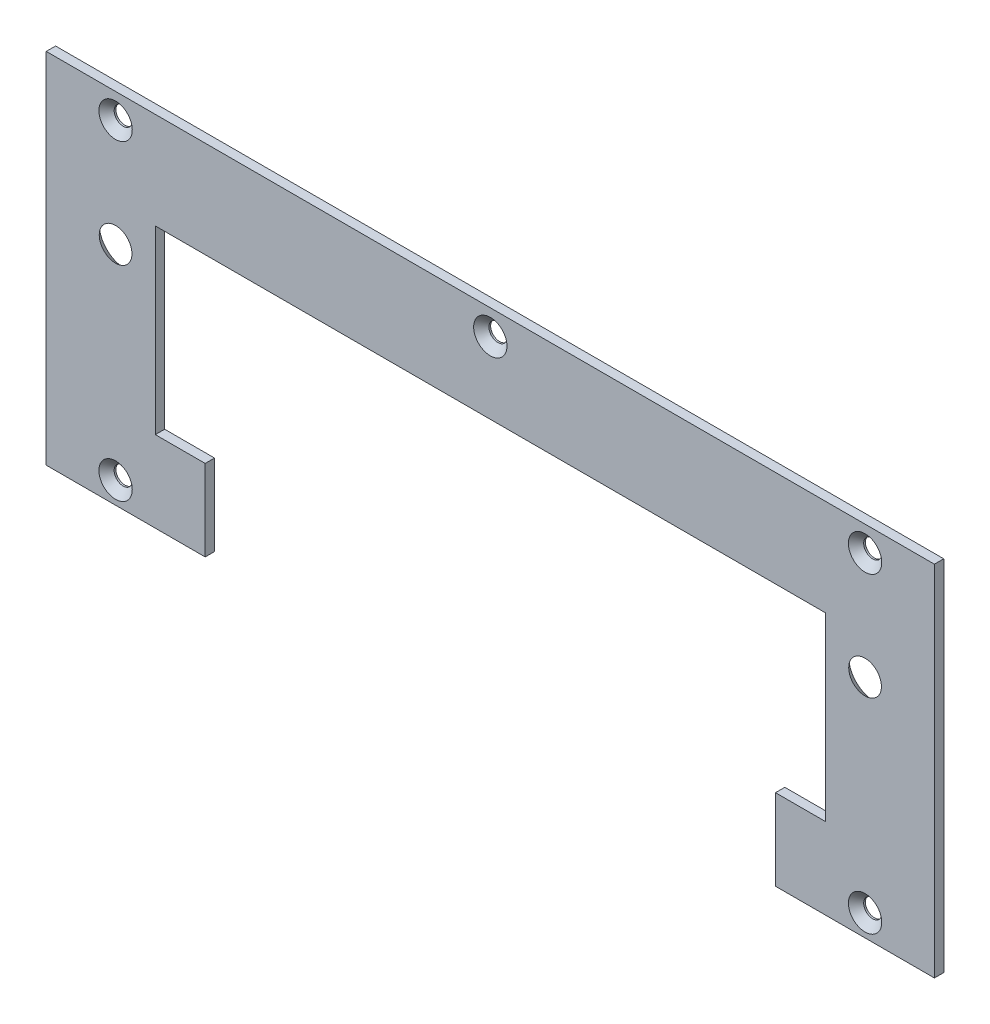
ISO-10303-21;
HEADER;
FILE_DESCRIPTION(('STEP AP214'),'2;1');
FILE_NAME('part.step','',(''),(''),'','','');
FILE_SCHEMA(('AUTOMOTIVE_DESIGN { 1 0 10303 214 1 1 1 1 }'));
ENDSEC;
DATA;
#1=APPLICATION_CONTEXT('core data for automotive mechanical design processes');
#2=APPLICATION_PROTOCOL_DEFINITION('international standard','automotive_design',2000,#1);
#3=PRODUCT_CONTEXT('',#1,'mechanical');
#4=PRODUCT('Part','Part','',(#3));
#5=PRODUCT_RELATED_PRODUCT_CATEGORY('part','',(#4));
#6=PRODUCT_DEFINITION_FORMATION('','',#4);
#7=PRODUCT_DEFINITION_CONTEXT('part definition',#1,'design');
#8=PRODUCT_DEFINITION('design','',#6,#7);
#9=PRODUCT_DEFINITION_SHAPE('','',#8);
#10=(LENGTH_UNIT() NAMED_UNIT(*) SI_UNIT(.MILLI.,.METRE.));
#11=(NAMED_UNIT(*) PLANE_ANGLE_UNIT() SI_UNIT($,.RADIAN.));
#12=(NAMED_UNIT(*) SI_UNIT($,.STERADIAN.) SOLID_ANGLE_UNIT());
#13=UNCERTAINTY_MEASURE_WITH_UNIT(LENGTH_MEASURE(1.E-05),#10,'distance_accuracy_value','');
#14=(GEOMETRIC_REPRESENTATION_CONTEXT(3) GLOBAL_UNCERTAINTY_ASSIGNED_CONTEXT((#13)) GLOBAL_UNIT_ASSIGNED_CONTEXT((#10,
#11,#12)) REPRESENTATION_CONTEXT('',''));
#15=CARTESIAN_POINT('',(0.,0.,0.));
#16=DIRECTION('',(0.,0.,1.));
#17=DIRECTION('',(1.,0.,0.));
#18=AXIS2_PLACEMENT_3D('',#15,#16,#17);
#19=CARTESIAN_POINT('',(0.,54.7170542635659,0.));
#20=DIRECTION('',(0.,0.,1.));
#21=DIRECTION('',(1.,0.,0.));
#22=AXIS2_PLACEMENT_3D('',#19,#20,#21);
#23=PLANE('',#22);
#24=CARTESIAN_POINT('',(-120.25,-8.,0.));
#25=DIRECTION('',(0.,0.,1.));
#26=DIRECTION('',(1.,0.,0.));
#27=AXIS2_PLACEMENT_3D('',#24,#25,#26);
#28=CIRCLE('',#27,5.34999999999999);
#29=CARTESIAN_POINT('',(-114.9,-8.,0.));
#30=VERTEX_POINT('',#29);
#31=EDGE_CURVE('E125',#30,#30,#28,.F.);
#32=ORIENTED_EDGE('',*,*,#31,.T.);
#33=EDGE_LOOP('',(#32));
#34=FACE_BOUND('',#33,.T.);
#35=CARTESIAN_POINT('',(-120.25,92.,0.));
#36=DIRECTION('',(0.,0.,1.));
#37=DIRECTION('',(1.,0.,0.));
#38=AXIS2_PLACEMENT_3D('',#35,#36,#37);
#39=CIRCLE('',#38,5.34999999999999);
#40=CARTESIAN_POINT('',(-114.9,92.,0.));
#41=VERTEX_POINT('',#40);
#42=EDGE_CURVE('E161',#41,#41,#39,.F.);
#43=ORIENTED_EDGE('',*,*,#42,.T.);
#44=EDGE_LOOP('',(#43));
#45=FACE_BOUND('',#44,.T.);
#46=CARTESIAN_POINT('',(0.,92.,0.));
#47=DIRECTION('',(0.,0.,1.));
#48=DIRECTION('',(1.,0.,0.));
#49=AXIS2_PLACEMENT_3D('',#46,#47,#48);
#50=CIRCLE('',#49,5.35);
#51=CARTESIAN_POINT('',(5.35000000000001,92.,0.));
#52=VERTEX_POINT('',#51);
#53=EDGE_CURVE('E164',#52,#52,#50,.F.);
#54=ORIENTED_EDGE('',*,*,#53,.T.);
#55=EDGE_LOOP('',(#54));
#56=FACE_BOUND('',#55,.T.);
#57=CARTESIAN_POINT('',(120.25,92.,0.));
#58=DIRECTION('',(0.,0.,1.));
#59=DIRECTION('',(1.,0.,0.));
#60=AXIS2_PLACEMENT_3D('',#57,#58,#59);
#61=CIRCLE('',#60,5.35000000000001);
#62=CARTESIAN_POINT('',(125.6,92.,0.));
#63=VERTEX_POINT('',#62);
#64=EDGE_CURVE('E166',#63,#63,#61,.F.);
#65=ORIENTED_EDGE('',*,*,#64,.T.);
#66=EDGE_LOOP('',(#65));
#67=FACE_BOUND('',#66,.T.);
#68=CARTESIAN_POINT('',(120.25,-8.00000000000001,0.));
#69=DIRECTION('',(0.,0.,1.));
#70=DIRECTION('',(1.,0.,0.));
#71=AXIS2_PLACEMENT_3D('',#68,#69,#70);
#72=CIRCLE('',#71,5.35000000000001);
#73=CARTESIAN_POINT('',(125.6,-8.00000000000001,0.));
#74=VERTEX_POINT('',#73);
#75=EDGE_CURVE('E19',#74,#74,#72,.F.);
#76=ORIENTED_EDGE('',*,*,#75,.T.);
#77=EDGE_LOOP('',(#76));
#78=FACE_BOUND('',#77,.T.);
#79=CARTESIAN_POINT('',(120.25,57.5,0.));
#80=DIRECTION('',(0.,0.,-1.));
#81=DIRECTION('',(-1.,0.,0.));
#82=AXIS2_PLACEMENT_3D('',#79,#80,#81);
#83=CIRCLE('',#82,5.25000000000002);
#84=CARTESIAN_POINT('',(115.,57.5,0.));
#85=VERTEX_POINT('',#84);
#86=EDGE_CURVE('E152',#85,#85,#83,.T.);
#87=ORIENTED_EDGE('',*,*,#86,.T.);
#88=EDGE_LOOP('',(#87));
#89=FACE_BOUND('',#88,.T.);
#90=CARTESIAN_POINT('',(-120.25,57.5,0.));
#91=DIRECTION('',(0.,0.,-1.));
#92=DIRECTION('',(-1.,0.,0.));
#93=AXIS2_PLACEMENT_3D('',#90,#91,#92);
#94=CIRCLE('',#93,5.24999999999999);
#95=CARTESIAN_POINT('',(-125.5,57.5,0.));
#96=VERTEX_POINT('',#95);
#97=EDGE_CURVE('E156',#96,#96,#94,.T.);
#98=ORIENTED_EDGE('',*,*,#97,.T.);
#99=EDGE_LOOP('',(#98));
#100=FACE_BOUND('',#99,.T.);
#101=DIRECTION('',(0.,1.,0.));
#102=VECTOR('',#101,1.);
#103=CARTESIAN_POINT('',(-142.5,100.,0.));
#104=LINE('',#103,#102);
#105=CARTESIAN_POINT('',(-142.5,-15.,0.));
#106=VERTEX_POINT('',#105);
#107=CARTESIAN_POINT('',(-142.5,100.,0.));
#108=VERTEX_POINT('',#107);
#109=EDGE_CURVE('E370',#106,#108,#104,.T.);
#110=ORIENTED_EDGE('',*,*,#109,.F.);
#111=DIRECTION('',(1.,0.,0.));
#112=VECTOR('',#111,1.);
#113=CARTESIAN_POINT('',(-142.5,-15.,0.));
#114=LINE('',#113,#112);
#115=CARTESIAN_POINT('',(-91.5,-15.,0.));
#116=VERTEX_POINT('',#115);
#117=EDGE_CURVE('E366',#116,#106,#114,.F.);
#118=ORIENTED_EDGE('',*,*,#117,.F.);
#119=DIRECTION('',(0.,1.,0.));
#120=VECTOR('',#119,1.);
#121=CARTESIAN_POINT('',(-91.5,-15.,0.));
#122=LINE('',#121,#120);
#123=CARTESIAN_POINT('',(-91.5,11.,0.));
#124=VERTEX_POINT('',#123);
#125=EDGE_CURVE('E363',#124,#116,#122,.F.);
#126=ORIENTED_EDGE('',*,*,#125,.F.);
#127=DIRECTION('',(1.,0.,0.));
#128=VECTOR('',#127,1.);
#129=CARTESIAN_POINT('',(-91.5,11.,0.));
#130=LINE('',#129,#128);
#131=CARTESIAN_POINT('',(-107.5,11.,0.));
#132=VERTEX_POINT('',#131);
#133=EDGE_CURVE('E121',#132,#124,#130,.T.);
#134=ORIENTED_EDGE('',*,*,#133,.F.);
#135=DIRECTION('',(0.,1.,0.));
#136=VECTOR('',#135,1.);
#137=CARTESIAN_POINT('',(-107.5,11.,0.));
#138=LINE('',#137,#136);
#139=CARTESIAN_POINT('',(-107.5,69.,0.));
#140=VERTEX_POINT('',#139);
#141=EDGE_CURVE('E116',#140,#132,#138,.F.);
#142=ORIENTED_EDGE('',*,*,#141,.F.);
#143=DIRECTION('',(1.,0.,0.));
#144=VECTOR('',#143,1.);
#145=CARTESIAN_POINT('',(-107.5,69.,0.));
#146=LINE('',#145,#144);
#147=CARTESIAN_POINT('',(107.5,69.,0.));
#148=VERTEX_POINT('',#147);
#149=EDGE_CURVE('E107',#148,#140,#146,.F.);
#150=ORIENTED_EDGE('',*,*,#149,.F.);
#151=DIRECTION('',(0.,1.,0.));
#152=VECTOR('',#151,1.);
#153=CARTESIAN_POINT('',(107.5,69.,0.));
#154=LINE('',#153,#152);
#155=CARTESIAN_POINT('',(107.5,11.,0.));
#156=VERTEX_POINT('',#155);
#157=EDGE_CURVE('E102',#156,#148,#154,.T.);
#158=ORIENTED_EDGE('',*,*,#157,.F.);
#159=DIRECTION('',(1.,0.,0.));
#160=VECTOR('',#159,1.);
#161=CARTESIAN_POINT('',(107.5,11.,0.));
#162=LINE('',#161,#160);
#163=CARTESIAN_POINT('',(91.5,11.,0.));
#164=VERTEX_POINT('',#163);
#165=EDGE_CURVE('E390',#164,#156,#162,.T.);
#166=ORIENTED_EDGE('',*,*,#165,.F.);
#167=DIRECTION('',(0.,1.,0.));
#168=VECTOR('',#167,1.);
#169=CARTESIAN_POINT('',(91.5,11.,0.));
#170=LINE('',#169,#168);
#171=CARTESIAN_POINT('',(91.5,-15.,0.));
#172=VERTEX_POINT('',#171);
#173=EDGE_CURVE('E386',#172,#164,#170,.T.);
#174=ORIENTED_EDGE('',*,*,#173,.F.);
#175=DIRECTION('',(1.,0.,0.));
#176=VECTOR('',#175,1.);
#177=CARTESIAN_POINT('',(91.5,-15.,0.));
#178=LINE('',#177,#176);
#179=CARTESIAN_POINT('',(142.5,-15.,0.));
#180=VERTEX_POINT('',#179);
#181=EDGE_CURVE('E382',#180,#172,#178,.F.);
#182=ORIENTED_EDGE('',*,*,#181,.F.);
#183=DIRECTION('',(0.,1.,0.));
#184=VECTOR('',#183,1.);
#185=CARTESIAN_POINT('',(142.5,-15.,0.));
#186=LINE('',#185,#184);
#187=CARTESIAN_POINT('',(142.5,100.,0.));
#188=VERTEX_POINT('',#187);
#189=EDGE_CURVE('E378',#188,#180,#186,.F.);
#190=ORIENTED_EDGE('',*,*,#189,.F.);
#191=DIRECTION('',(1.,0.,0.));
#192=VECTOR('',#191,1.);
#193=CARTESIAN_POINT('',(142.5,100.,0.));
#194=LINE('',#193,#192);
#195=EDGE_CURVE('E374',#108,#188,#194,.T.);
#196=ORIENTED_EDGE('',*,*,#195,.F.);
#197=EDGE_LOOP('',(#110,#118,#126,#134,#142,#150,#158,#166,#174,#182,#190,#196));
#198=FACE_BOUND('',#197,.T.);
#199=ADVANCED_FACE('F15',(#34,#45,#56,#67,#78,#89,#100,#198),#23,.T.);
#200=CARTESIAN_POINT('',(120.25,-8.00000000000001,0.));
#201=DIRECTION('',(0.,0.,1.));
#202=DIRECTION('',(1.,0.,0.));
#203=AXIS2_PLACEMENT_3D('',#200,#201,#202);
#204=CONICAL_SURFACE('',#203,5.34999999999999,0.785398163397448);
#205=CARTESIAN_POINT('',(120.25,-8.00000000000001,-2.44999999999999));
#206=DIRECTION('',(0.,0.,-1.));
#207=DIRECTION('',(-1.,0.,0.));
#208=AXIS2_PLACEMENT_3D('',#205,#206,#207);
#209=CIRCLE('',#208,2.9);
#210=CARTESIAN_POINT('',(117.35,-8.00000000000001,-2.44999999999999));
#211=VERTEX_POINT('',#210);
#212=EDGE_CURVE('E155',#211,#211,#209,.T.);
#213=ORIENTED_EDGE('',*,*,#212,.T.);
#214=EDGE_LOOP('',(#213));
#215=FACE_BOUND('',#214,.T.);
#216=ORIENTED_EDGE('',*,*,#75,.F.);
#217=EDGE_LOOP('',(#216));
#218=FACE_BOUND('',#217,.T.);
#219=ADVANCED_FACE('F175',(#215,#218),#204,.F.);
#220=CARTESIAN_POINT('',(120.25,92.,0.));
#221=DIRECTION('',(0.,0.,1.));
#222=DIRECTION('',(1.,0.,0.));
#223=AXIS2_PLACEMENT_3D('',#220,#221,#222);
#224=CONICAL_SURFACE('',#223,5.34999999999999,0.785398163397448);
#225=CARTESIAN_POINT('',(120.25,92.,-2.44999999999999));
#226=DIRECTION('',(0.,0.,-1.));
#227=DIRECTION('',(-1.,0.,0.));
#228=AXIS2_PLACEMENT_3D('',#225,#226,#227);
#229=CIRCLE('',#228,2.89999999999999);
#230=CARTESIAN_POINT('',(117.35,92.,-2.44999999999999));
#231=VERTEX_POINT('',#230);
#232=EDGE_CURVE('E348',#231,#231,#229,.T.);
#233=ORIENTED_EDGE('',*,*,#232,.T.);
#234=EDGE_LOOP('',(#233));
#235=FACE_BOUND('',#234,.T.);
#236=ORIENTED_EDGE('',*,*,#64,.F.);
#237=EDGE_LOOP('',(#236));
#238=FACE_BOUND('',#237,.T.);
#239=ADVANCED_FACE('F177',(#235,#238),#224,.F.);
#240=CARTESIAN_POINT('',(0.,92.,0.));
#241=DIRECTION('',(0.,0.,1.));
#242=DIRECTION('',(1.,0.,0.));
#243=AXIS2_PLACEMENT_3D('',#240,#241,#242);
#244=CONICAL_SURFACE('',#243,5.35,0.785398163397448);
#245=CARTESIAN_POINT('',(0.,92.,-2.44999999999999));
#246=DIRECTION('',(0.,0.,-1.));
#247=DIRECTION('',(-1.,0.,0.));
#248=AXIS2_PLACEMENT_3D('',#245,#246,#247);
#249=CIRCLE('',#248,2.9);
#250=CARTESIAN_POINT('',(-2.89999999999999,92.,-2.44999999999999));
#251=VERTEX_POINT('',#250);
#252=EDGE_CURVE('E343',#251,#251,#249,.T.);
#253=ORIENTED_EDGE('',*,*,#252,.T.);
#254=EDGE_LOOP('',(#253));
#255=FACE_BOUND('',#254,.T.);
#256=ORIENTED_EDGE('',*,*,#53,.F.);
#257=EDGE_LOOP('',(#256));
#258=FACE_BOUND('',#257,.T.);
#259=ADVANCED_FACE('F185',(#255,#258),#244,.F.);
#260=CARTESIAN_POINT('',(-120.25,92.,0.));
#261=DIRECTION('',(0.,0.,1.));
#262=DIRECTION('',(1.,0.,0.));
#263=AXIS2_PLACEMENT_3D('',#260,#261,#262);
#264=CONICAL_SURFACE('',#263,5.34999999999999,0.785398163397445);
#265=CARTESIAN_POINT('',(-120.25,92.,-2.44999999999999));
#266=DIRECTION('',(0.,0.,-1.));
#267=DIRECTION('',(-1.,0.,0.));
#268=AXIS2_PLACEMENT_3D('',#265,#266,#267);
#269=CIRCLE('',#268,2.90000000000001);
#270=CARTESIAN_POINT('',(-123.15,92.,-2.44999999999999));
#271=VERTEX_POINT('',#270);
#272=EDGE_CURVE('E286',#271,#271,#269,.T.);
#273=ORIENTED_EDGE('',*,*,#272,.T.);
#274=EDGE_LOOP('',(#273));
#275=FACE_BOUND('',#274,.T.);
#276=ORIENTED_EDGE('',*,*,#42,.F.);
#277=EDGE_LOOP('',(#276));
#278=FACE_BOUND('',#277,.T.);
#279=ADVANCED_FACE('F249',(#275,#278),#264,.F.);
#280=CARTESIAN_POINT('',(-120.25,-8.,0.));
#281=DIRECTION('',(0.,0.,1.));
#282=DIRECTION('',(1.,0.,0.));
#283=AXIS2_PLACEMENT_3D('',#280,#281,#282);
#284=CONICAL_SURFACE('',#283,5.34999999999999,0.785398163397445);
#285=CARTESIAN_POINT('',(-120.25,-8.,-2.44999999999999));
#286=DIRECTION('',(0.,0.,-1.));
#287=DIRECTION('',(-1.,0.,0.));
#288=AXIS2_PLACEMENT_3D('',#285,#286,#287);
#289=CIRCLE('',#288,2.90000000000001);
#290=CARTESIAN_POINT('',(-123.15,-8.,-2.44999999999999));
#291=VERTEX_POINT('',#290);
#292=EDGE_CURVE('E338',#291,#291,#289,.T.);
#293=ORIENTED_EDGE('',*,*,#292,.T.);
#294=EDGE_LOOP('',(#293));
#295=FACE_BOUND('',#294,.T.);
#296=ORIENTED_EDGE('',*,*,#31,.F.);
#297=EDGE_LOOP('',(#296));
#298=FACE_BOUND('',#297,.T.);
#299=ADVANCED_FACE('F245',(#295,#298),#284,.F.);
#300=CARTESIAN_POINT('',(-107.5,11.,0.));
#301=DIRECTION('',(1.,0.,0.));
#302=DIRECTION('',(0.,0.,-1.));
#303=AXIS2_PLACEMENT_3D('',#300,#301,#302);
#304=PLANE('',#303);
#305=ORIENTED_EDGE('',*,*,#141,.T.);
#306=DIRECTION('',(0.,0.,1.));
#307=VECTOR('',#306,1.);
#308=CARTESIAN_POINT('',(-107.5,11.,0.));
#309=LINE('',#308,#307);
#310=CARTESIAN_POINT('',(-107.5,11.,-3.));
#311=VERTEX_POINT('',#310);
#312=EDGE_CURVE('E360',#311,#132,#309,.T.);
#313=ORIENTED_EDGE('',*,*,#312,.F.);
#314=DIRECTION('',(0.,1.,0.));
#315=VECTOR('',#314,1.);
#316=CARTESIAN_POINT('',(-107.5,54.7170542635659,-3.));
#317=LINE('',#316,#315);
#318=CARTESIAN_POINT('',(-107.5,69.,-3.));
#319=VERTEX_POINT('',#318);
#320=EDGE_CURVE('E129',#311,#319,#317,.T.);
#321=ORIENTED_EDGE('',*,*,#320,.T.);
#322=DIRECTION('',(0.,0.,-1.));
#323=VECTOR('',#322,1.);
#324=CARTESIAN_POINT('',(-107.5,69.,0.));
#325=LINE('',#324,#323);
#326=EDGE_CURVE('E112',#140,#319,#325,.T.);
#327=ORIENTED_EDGE('',*,*,#326,.F.);
#328=EDGE_LOOP('',(#305,#313,#321,#327));
#329=FACE_BOUND('',#328,.T.);
#330=ADVANCED_FACE('F128',(#329),#304,.T.);
#331=CARTESIAN_POINT('',(-107.5,69.,0.));
#332=DIRECTION('',(0.,-1.,0.));
#333=DIRECTION('',(0.,0.,-1.));
#334=AXIS2_PLACEMENT_3D('',#331,#332,#333);
#335=PLANE('',#334);
#336=ORIENTED_EDGE('',*,*,#149,.T.);
#337=ORIENTED_EDGE('',*,*,#326,.T.);
#338=DIRECTION('',(1.,0.,0.));
#339=VECTOR('',#338,1.);
#340=CARTESIAN_POINT('',(0.,69.,-3.));
#341=LINE('',#340,#339);
#342=CARTESIAN_POINT('',(107.5,69.,-3.));
#343=VERTEX_POINT('',#342);
#344=EDGE_CURVE('E335',#319,#343,#341,.T.);
#345=ORIENTED_EDGE('',*,*,#344,.T.);
#346=DIRECTION('',(0.,0.,1.));
#347=VECTOR('',#346,1.);
#348=CARTESIAN_POINT('',(107.5,69.,0.));
#349=LINE('',#348,#347);
#350=EDGE_CURVE('E114',#148,#343,#349,.F.);
#351=ORIENTED_EDGE('',*,*,#350,.F.);
#352=EDGE_LOOP('',(#336,#337,#345,#351));
#353=FACE_BOUND('',#352,.T.);
#354=ADVANCED_FACE('F109',(#353),#335,.T.);
#355=CARTESIAN_POINT('',(107.5,69.,0.));
#356=DIRECTION('',(-1.,0.,0.));
#357=DIRECTION('',(0.,0.,1.));
#358=AXIS2_PLACEMENT_3D('',#355,#356,#357);
#359=PLANE('',#358);
#360=ORIENTED_EDGE('',*,*,#157,.T.);
#361=ORIENTED_EDGE('',*,*,#350,.T.);
#362=DIRECTION('',(0.,1.,0.));
#363=VECTOR('',#362,1.);
#364=CARTESIAN_POINT('',(107.5,54.7170542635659,-3.));
#365=LINE('',#364,#363);
#366=CARTESIAN_POINT('',(107.5,11.,-3.));
#367=VERTEX_POINT('',#366);
#368=EDGE_CURVE('E332',#343,#367,#365,.F.);
#369=ORIENTED_EDGE('',*,*,#368,.T.);
#370=DIRECTION('',(0.,0.,1.));
#371=VECTOR('',#370,1.);
#372=CARTESIAN_POINT('',(107.5,11.,0.));
#373=LINE('',#372,#371);
#374=EDGE_CURVE('E388',#156,#367,#373,.F.);
#375=ORIENTED_EDGE('',*,*,#374,.F.);
#376=EDGE_LOOP('',(#360,#361,#369,#375));
#377=FACE_BOUND('',#376,.T.);
#378=ADVANCED_FACE('F238',(#377),#359,.T.);
#379=CARTESIAN_POINT('',(107.5,11.,0.));
#380=DIRECTION('',(0.,1.,0.));
#381=DIRECTION('',(0.,0.,1.));
#382=AXIS2_PLACEMENT_3D('',#379,#380,#381);
#383=PLANE('',#382);
#384=ORIENTED_EDGE('',*,*,#165,.T.);
#385=ORIENTED_EDGE('',*,*,#374,.T.);
#386=DIRECTION('',(1.,0.,0.));
#387=VECTOR('',#386,1.);
#388=CARTESIAN_POINT('',(0.,11.,-3.));
#389=LINE('',#388,#387);
#390=CARTESIAN_POINT('',(91.5,11.,-3.));
#391=VERTEX_POINT('',#390);
#392=EDGE_CURVE('E329',#367,#391,#389,.F.);
#393=ORIENTED_EDGE('',*,*,#392,.T.);
#394=DIRECTION('',(0.,0.,1.));
#395=VECTOR('',#394,1.);
#396=CARTESIAN_POINT('',(91.5,11.,0.));
#397=LINE('',#396,#395);
#398=EDGE_CURVE('E384',#164,#391,#397,.F.);
#399=ORIENTED_EDGE('',*,*,#398,.F.);
#400=EDGE_LOOP('',(#384,#385,#393,#399));
#401=FACE_BOUND('',#400,.T.);
#402=ADVANCED_FACE('F234',(#401),#383,.T.);
#403=CARTESIAN_POINT('',(91.5,11.,0.));
#404=DIRECTION('',(-1.,0.,0.));
#405=DIRECTION('',(0.,0.,1.));
#406=AXIS2_PLACEMENT_3D('',#403,#404,#405);
#407=PLANE('',#406);
#408=ORIENTED_EDGE('',*,*,#173,.T.);
#409=ORIENTED_EDGE('',*,*,#398,.T.);
#410=DIRECTION('',(0.,1.,0.));
#411=VECTOR('',#410,1.);
#412=CARTESIAN_POINT('',(91.5,54.7170542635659,-3.));
#413=LINE('',#412,#411);
#414=CARTESIAN_POINT('',(91.5,-15.,-3.));
#415=VERTEX_POINT('',#414);
#416=EDGE_CURVE('E326',#391,#415,#413,.F.);
#417=ORIENTED_EDGE('',*,*,#416,.T.);
#418=DIRECTION('',(0.,0.,-1.));
#419=VECTOR('',#418,1.);
#420=CARTESIAN_POINT('',(91.5,-15.,0.));
#421=LINE('',#420,#419);
#422=EDGE_CURVE('E380',#172,#415,#421,.T.);
#423=ORIENTED_EDGE('',*,*,#422,.F.);
#424=EDGE_LOOP('',(#408,#409,#417,#423));
#425=FACE_BOUND('',#424,.T.);
#426=ADVANCED_FACE('F230',(#425),#407,.T.);
#427=CARTESIAN_POINT('',(91.5,-15.,0.));
#428=DIRECTION('',(0.,-1.,0.));
#429=DIRECTION('',(0.,0.,-1.));
#430=AXIS2_PLACEMENT_3D('',#427,#428,#429);
#431=PLANE('',#430);
#432=ORIENTED_EDGE('',*,*,#181,.T.);
#433=ORIENTED_EDGE('',*,*,#422,.T.);
#434=DIRECTION('',(1.,0.,0.));
#435=VECTOR('',#434,1.);
#436=CARTESIAN_POINT('',(0.,-15.,-3.));
#437=LINE('',#436,#435);
#438=CARTESIAN_POINT('',(142.5,-15.,-3.));
#439=VERTEX_POINT('',#438);
#440=EDGE_CURVE('E323',#415,#439,#437,.T.);
#441=ORIENTED_EDGE('',*,*,#440,.T.);
#442=DIRECTION('',(0.,0.,-1.));
#443=VECTOR('',#442,1.);
#444=CARTESIAN_POINT('',(142.5,-15.,0.));
#445=LINE('',#444,#443);
#446=EDGE_CURVE('E376',#180,#439,#445,.T.);
#447=ORIENTED_EDGE('',*,*,#446,.F.);
#448=EDGE_LOOP('',(#432,#433,#441,#447));
#449=FACE_BOUND('',#448,.T.);
#450=ADVANCED_FACE('F226',(#449),#431,.T.);
#451=CARTESIAN_POINT('',(142.5,-15.,0.));
#452=DIRECTION('',(1.,0.,0.));
#453=DIRECTION('',(0.,0.,-1.));
#454=AXIS2_PLACEMENT_3D('',#451,#452,#453);
#455=PLANE('',#454);
#456=ORIENTED_EDGE('',*,*,#189,.T.);
#457=ORIENTED_EDGE('',*,*,#446,.T.);
#458=DIRECTION('',(0.,1.,0.));
#459=VECTOR('',#458,1.);
#460=CARTESIAN_POINT('',(142.5,54.7170542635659,-3.));
#461=LINE('',#460,#459);
#462=CARTESIAN_POINT('',(142.5,100.,-3.));
#463=VERTEX_POINT('',#462);
#464=EDGE_CURVE('E320',#439,#463,#461,.T.);
#465=ORIENTED_EDGE('',*,*,#464,.T.);
#466=DIRECTION('',(0.,0.,1.));
#467=VECTOR('',#466,1.);
#468=CARTESIAN_POINT('',(142.5,100.,0.));
#469=LINE('',#468,#467);
#470=EDGE_CURVE('E372',#188,#463,#469,.F.);
#471=ORIENTED_EDGE('',*,*,#470,.F.);
#472=EDGE_LOOP('',(#456,#457,#465,#471));
#473=FACE_BOUND('',#472,.T.);
#474=ADVANCED_FACE('F222',(#473),#455,.T.);
#475=CARTESIAN_POINT('',(142.5,100.,0.));
#476=DIRECTION('',(0.,1.,0.));
#477=DIRECTION('',(0.,0.,1.));
#478=AXIS2_PLACEMENT_3D('',#475,#476,#477);
#479=PLANE('',#478);
#480=ORIENTED_EDGE('',*,*,#195,.T.);
#481=ORIENTED_EDGE('',*,*,#470,.T.);
#482=DIRECTION('',(1.,0.,0.));
#483=VECTOR('',#482,1.);
#484=CARTESIAN_POINT('',(0.,100.,-3.));
#485=LINE('',#484,#483);
#486=CARTESIAN_POINT('',(-142.5,100.,-3.));
#487=VERTEX_POINT('',#486);
#488=EDGE_CURVE('E314',#463,#487,#485,.F.);
#489=ORIENTED_EDGE('',*,*,#488,.T.);
#490=DIRECTION('',(0.,0.,1.));
#491=VECTOR('',#490,1.);
#492=CARTESIAN_POINT('',(-142.5,100.,0.));
#493=LINE('',#492,#491);
#494=EDGE_CURVE('E368',#108,#487,#493,.F.);
#495=ORIENTED_EDGE('',*,*,#494,.F.);
#496=EDGE_LOOP('',(#480,#481,#489,#495));
#497=FACE_BOUND('',#496,.T.);
#498=ADVANCED_FACE('F218',(#497),#479,.T.);
#499=CARTESIAN_POINT('',(-142.5,100.,0.));
#500=DIRECTION('',(-1.,0.,0.));
#501=DIRECTION('',(0.,0.,1.));
#502=AXIS2_PLACEMENT_3D('',#499,#500,#501);
#503=PLANE('',#502);
#504=ORIENTED_EDGE('',*,*,#109,.T.);
#505=ORIENTED_EDGE('',*,*,#494,.T.);
#506=DIRECTION('',(0.,1.,0.));
#507=VECTOR('',#506,1.);
#508=CARTESIAN_POINT('',(-142.5,54.7170542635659,-3.));
#509=LINE('',#508,#507);
#510=CARTESIAN_POINT('',(-142.5,-15.,-3.));
#511=VERTEX_POINT('',#510);
#512=EDGE_CURVE('E312',#487,#511,#509,.F.);
#513=ORIENTED_EDGE('',*,*,#512,.T.);
#514=DIRECTION('',(0.,0.,-1.));
#515=VECTOR('',#514,1.);
#516=CARTESIAN_POINT('',(-142.5,-15.,0.));
#517=LINE('',#516,#515);
#518=EDGE_CURVE('E311',#106,#511,#517,.T.);
#519=ORIENTED_EDGE('',*,*,#518,.F.);
#520=EDGE_LOOP('',(#504,#505,#513,#519));
#521=FACE_BOUND('',#520,.T.);
#522=ADVANCED_FACE('F214',(#521),#503,.T.);
#523=CARTESIAN_POINT('',(-142.5,-15.,0.));
#524=DIRECTION('',(0.,-1.,0.));
#525=DIRECTION('',(0.,0.,-1.));
#526=AXIS2_PLACEMENT_3D('',#523,#524,#525);
#527=PLANE('',#526);
#528=ORIENTED_EDGE('',*,*,#117,.T.);
#529=ORIENTED_EDGE('',*,*,#518,.T.);
#530=DIRECTION('',(1.,0.,0.));
#531=VECTOR('',#530,1.);
#532=CARTESIAN_POINT('',(0.,-15.,-3.));
#533=LINE('',#532,#531);
#534=CARTESIAN_POINT('',(-91.5,-15.,-3.));
#535=VERTEX_POINT('',#534);
#536=EDGE_CURVE('E305',#511,#535,#533,.T.);
#537=ORIENTED_EDGE('',*,*,#536,.T.);
#538=DIRECTION('',(0.,0.,-1.));
#539=VECTOR('',#538,1.);
#540=CARTESIAN_POINT('',(-91.5,-15.,0.));
#541=LINE('',#540,#539);
#542=EDGE_CURVE('E309',#116,#535,#541,.T.);
#543=ORIENTED_EDGE('',*,*,#542,.F.);
#544=EDGE_LOOP('',(#528,#529,#537,#543));
#545=FACE_BOUND('',#544,.T.);
#546=ADVANCED_FACE('F210',(#545),#527,.T.);
#547=CARTESIAN_POINT('',(-91.5,-15.,0.));
#548=DIRECTION('',(1.,0.,0.));
#549=DIRECTION('',(0.,0.,-1.));
#550=AXIS2_PLACEMENT_3D('',#547,#548,#549);
#551=PLANE('',#550);
#552=ORIENTED_EDGE('',*,*,#125,.T.);
#553=ORIENTED_EDGE('',*,*,#542,.T.);
#554=DIRECTION('',(0.,1.,0.));
#555=VECTOR('',#554,1.);
#556=CARTESIAN_POINT('',(-91.5,54.7170542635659,-3.));
#557=LINE('',#556,#555);
#558=CARTESIAN_POINT('',(-91.5,11.,-3.));
#559=VERTEX_POINT('',#558);
#560=EDGE_CURVE('E302',#535,#559,#557,.T.);
#561=ORIENTED_EDGE('',*,*,#560,.T.);
#562=DIRECTION('',(0.,0.,1.));
#563=VECTOR('',#562,1.);
#564=CARTESIAN_POINT('',(-91.5,11.,0.));
#565=LINE('',#564,#563);
#566=EDGE_CURVE('E34',#124,#559,#565,.F.);
#567=ORIENTED_EDGE('',*,*,#566,.F.);
#568=EDGE_LOOP('',(#552,#553,#561,#567));
#569=FACE_BOUND('',#568,.T.);
#570=ADVANCED_FACE('F207',(#569),#551,.T.);
#571=CARTESIAN_POINT('',(-91.5,11.,0.));
#572=DIRECTION('',(0.,1.,0.));
#573=DIRECTION('',(0.,0.,1.));
#574=AXIS2_PLACEMENT_3D('',#571,#572,#573);
#575=PLANE('',#574);
#576=ORIENTED_EDGE('',*,*,#133,.T.);
#577=ORIENTED_EDGE('',*,*,#566,.T.);
#578=DIRECTION('',(1.,0.,0.));
#579=VECTOR('',#578,1.);
#580=CARTESIAN_POINT('',(0.,11.,-3.));
#581=LINE('',#580,#579);
#582=EDGE_CURVE('E151',#559,#311,#581,.F.);
#583=ORIENTED_EDGE('',*,*,#582,.T.);
#584=ORIENTED_EDGE('',*,*,#312,.T.);
#585=EDGE_LOOP('',(#576,#577,#583,#584));
#586=FACE_BOUND('',#585,.T.);
#587=ADVANCED_FACE('F203',(#586),#575,.T.);
#588=CARTESIAN_POINT('',(-120.25,57.5,-3.));
#589=DIRECTION('',(0.,0.,-1.));
#590=DIRECTION('',(-1.,0.,0.));
#591=AXIS2_PLACEMENT_3D('',#588,#589,#590);
#592=CONICAL_SURFACE('',#591,8.24999999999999,0.785398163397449);
#593=CARTESIAN_POINT('',(-120.25,57.5,-3.00000000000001));
#594=DIRECTION('',(0.,0.,-1.));
#595=DIRECTION('',(-1.,0.,0.));
#596=AXIS2_PLACEMENT_3D('',#593,#594,#595);
#597=CIRCLE('',#596,8.25000000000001);
#598=CARTESIAN_POINT('',(-128.5,57.5,-3.00000000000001));
#599=VERTEX_POINT('',#598);
#600=EDGE_CURVE('E148',#599,#599,#597,.T.);
#601=ORIENTED_EDGE('',*,*,#600,.T.);
#602=EDGE_LOOP('',(#601));
#603=FACE_BOUND('',#602,.T.);
#604=ORIENTED_EDGE('',*,*,#97,.F.);
#605=EDGE_LOOP('',(#604));
#606=FACE_BOUND('',#605,.T.);
#607=ADVANCED_FACE('F206',(#603,#606),#592,.F.);
#608=CARTESIAN_POINT('',(120.25,57.5,-3.));
#609=DIRECTION('',(0.,0.,-1.));
#610=DIRECTION('',(-1.,0.,0.));
#611=AXIS2_PLACEMENT_3D('',#608,#609,#610);
#612=CONICAL_SURFACE('',#611,8.25000000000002,0.785398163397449);
#613=CARTESIAN_POINT('',(120.25,57.5,-2.99999999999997));
#614=DIRECTION('',(0.,0.,-1.));
#615=DIRECTION('',(-1.,0.,0.));
#616=AXIS2_PLACEMENT_3D('',#613,#614,#615);
#617=CIRCLE('',#616,8.24999999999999);
#618=CARTESIAN_POINT('',(112.,57.5,-2.99999999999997));
#619=VERTEX_POINT('',#618);
#620=EDGE_CURVE('E145',#619,#619,#617,.T.);
#621=ORIENTED_EDGE('',*,*,#620,.T.);
#622=EDGE_LOOP('',(#621));
#623=FACE_BOUND('',#622,.T.);
#624=ORIENTED_EDGE('',*,*,#86,.F.);
#625=EDGE_LOOP('',(#624));
#626=FACE_BOUND('',#625,.T.);
#627=ADVANCED_FACE('F263',(#623,#626),#612,.F.);
#628=CARTESIAN_POINT('',(120.25,-8.00000000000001,-2.44999999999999));
#629=DIRECTION('',(0.,0.,-1.));
#630=DIRECTION('',(-1.,0.,0.));
#631=AXIS2_PLACEMENT_3D('',#628,#629,#630);
#632=CYLINDRICAL_SURFACE('',#631,2.9);
#633=ORIENTED_EDGE('',*,*,#212,.F.);
#634=EDGE_LOOP('',(#633));
#635=FACE_BOUND('',#634,.T.);
#636=CARTESIAN_POINT('',(120.25,-8.00000000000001,-3.));
#637=DIRECTION('',(0.,0.,-1.));
#638=DIRECTION('',(-1.,0.,0.));
#639=AXIS2_PLACEMENT_3D('',#636,#637,#638);
#640=CIRCLE('',#639,2.9);
#641=CARTESIAN_POINT('',(117.35,-8.00000000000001,-3.));
#642=VERTEX_POINT('',#641);
#643=EDGE_CURVE('E142',#642,#642,#640,.T.);
#644=ORIENTED_EDGE('',*,*,#643,.T.);
#645=EDGE_LOOP('',(#644));
#646=FACE_BOUND('',#645,.T.);
#647=ADVANCED_FACE('F267',(#635,#646),#632,.F.);
#648=CARTESIAN_POINT('',(120.25,92.,-2.44999999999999));
#649=DIRECTION('',(0.,0.,-1.));
#650=DIRECTION('',(-1.,0.,0.));
#651=AXIS2_PLACEMENT_3D('',#648,#649,#650);
#652=CYLINDRICAL_SURFACE('',#651,2.89999999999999);
#653=ORIENTED_EDGE('',*,*,#232,.F.);
#654=EDGE_LOOP('',(#653));
#655=FACE_BOUND('',#654,.T.);
#656=CARTESIAN_POINT('',(120.25,92.,-3.));
#657=DIRECTION('',(0.,0.,-1.));
#658=DIRECTION('',(-1.,0.,0.));
#659=AXIS2_PLACEMENT_3D('',#656,#657,#658);
#660=CIRCLE('',#659,2.89999999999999);
#661=CARTESIAN_POINT('',(117.35,92.,-3.));
#662=VERTEX_POINT('',#661);
#663=EDGE_CURVE('E139',#662,#662,#660,.T.);
#664=ORIENTED_EDGE('',*,*,#663,.T.);
#665=EDGE_LOOP('',(#664));
#666=FACE_BOUND('',#665,.T.);
#667=ADVANCED_FACE('F271',(#655,#666),#652,.F.);
#668=CARTESIAN_POINT('',(0.,92.,-2.44999999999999));
#669=DIRECTION('',(0.,0.,-1.));
#670=DIRECTION('',(-1.,0.,0.));
#671=AXIS2_PLACEMENT_3D('',#668,#669,#670);
#672=CYLINDRICAL_SURFACE('',#671,2.9);
#673=ORIENTED_EDGE('',*,*,#252,.F.);
#674=EDGE_LOOP('',(#673));
#675=FACE_BOUND('',#674,.T.);
#676=CARTESIAN_POINT('',(0.,92.,-3.));
#677=DIRECTION('',(0.,0.,-1.));
#678=DIRECTION('',(-1.,0.,0.));
#679=AXIS2_PLACEMENT_3D('',#676,#677,#678);
#680=CIRCLE('',#679,2.9);
#681=CARTESIAN_POINT('',(-2.89999999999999,92.,-3.));
#682=VERTEX_POINT('',#681);
#683=EDGE_CURVE('E136',#682,#682,#680,.T.);
#684=ORIENTED_EDGE('',*,*,#683,.T.);
#685=EDGE_LOOP('',(#684));
#686=FACE_BOUND('',#685,.T.);
#687=ADVANCED_FACE('F275',(#675,#686),#672,.F.);
#688=CARTESIAN_POINT('',(-120.25,92.,-2.44999999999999));
#689=DIRECTION('',(0.,0.,-1.));
#690=DIRECTION('',(-1.,0.,0.));
#691=AXIS2_PLACEMENT_3D('',#688,#689,#690);
#692=CYLINDRICAL_SURFACE('',#691,2.90000000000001);
#693=ORIENTED_EDGE('',*,*,#272,.F.);
#694=EDGE_LOOP('',(#693));
#695=FACE_BOUND('',#694,.T.);
#696=CARTESIAN_POINT('',(-120.25,92.,-3.));
#697=DIRECTION('',(0.,0.,-1.));
#698=DIRECTION('',(-1.,0.,0.));
#699=AXIS2_PLACEMENT_3D('',#696,#697,#698);
#700=CIRCLE('',#699,2.90000000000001);
#701=CARTESIAN_POINT('',(-123.15,92.,-3.));
#702=VERTEX_POINT('',#701);
#703=EDGE_CURVE('E25',#702,#702,#700,.T.);
#704=ORIENTED_EDGE('',*,*,#703,.T.);
#705=EDGE_LOOP('',(#704));
#706=FACE_BOUND('',#705,.T.);
#707=ADVANCED_FACE('F198',(#695,#706),#692,.F.);
#708=CARTESIAN_POINT('',(-120.25,-8.,-2.44999999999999));
#709=DIRECTION('',(0.,0.,-1.));
#710=DIRECTION('',(-1.,0.,0.));
#711=AXIS2_PLACEMENT_3D('',#708,#709,#710);
#712=CYLINDRICAL_SURFACE('',#711,2.90000000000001);
#713=ORIENTED_EDGE('',*,*,#292,.F.);
#714=EDGE_LOOP('',(#713));
#715=FACE_BOUND('',#714,.T.);
#716=CARTESIAN_POINT('',(-120.25,-8.,-3.));
#717=DIRECTION('',(0.,0.,-1.));
#718=DIRECTION('',(-1.,0.,0.));
#719=AXIS2_PLACEMENT_3D('',#716,#717,#718);
#720=CIRCLE('',#719,2.90000000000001);
#721=CARTESIAN_POINT('',(-123.15,-8.,-3.));
#722=VERTEX_POINT('',#721);
#723=EDGE_CURVE('E10',#722,#722,#720,.T.);
#724=ORIENTED_EDGE('',*,*,#723,.T.);
#725=EDGE_LOOP('',(#724));
#726=FACE_BOUND('',#725,.T.);
#727=ADVANCED_FACE('F17',(#715,#726),#712,.F.);
#728=CARTESIAN_POINT('',(0.,54.7170542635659,-3.));
#729=DIRECTION('',(0.,0.,1.));
#730=DIRECTION('',(1.,0.,0.));
#731=AXIS2_PLACEMENT_3D('',#728,#729,#730);
#732=PLANE('',#731);
#733=ORIENTED_EDGE('',*,*,#723,.F.);
#734=EDGE_LOOP('',(#733));
#735=FACE_BOUND('',#734,.T.);
#736=ORIENTED_EDGE('',*,*,#703,.F.);
#737=EDGE_LOOP('',(#736));
#738=FACE_BOUND('',#737,.T.);
#739=ORIENTED_EDGE('',*,*,#683,.F.);
#740=EDGE_LOOP('',(#739));
#741=FACE_BOUND('',#740,.T.);
#742=ORIENTED_EDGE('',*,*,#663,.F.);
#743=EDGE_LOOP('',(#742));
#744=FACE_BOUND('',#743,.T.);
#745=ORIENTED_EDGE('',*,*,#643,.F.);
#746=EDGE_LOOP('',(#745));
#747=FACE_BOUND('',#746,.T.);
#748=ORIENTED_EDGE('',*,*,#620,.F.);
#749=EDGE_LOOP('',(#748));
#750=FACE_BOUND('',#749,.T.);
#751=ORIENTED_EDGE('',*,*,#600,.F.);
#752=EDGE_LOOP('',(#751));
#753=FACE_BOUND('',#752,.T.);
#754=ORIENTED_EDGE('',*,*,#560,.F.);
#755=ORIENTED_EDGE('',*,*,#536,.F.);
#756=ORIENTED_EDGE('',*,*,#512,.F.);
#757=ORIENTED_EDGE('',*,*,#488,.F.);
#758=ORIENTED_EDGE('',*,*,#464,.F.);
#759=ORIENTED_EDGE('',*,*,#440,.F.);
#760=ORIENTED_EDGE('',*,*,#416,.F.);
#761=ORIENTED_EDGE('',*,*,#392,.F.);
#762=ORIENTED_EDGE('',*,*,#368,.F.);
#763=ORIENTED_EDGE('',*,*,#344,.F.);
#764=ORIENTED_EDGE('',*,*,#320,.F.);
#765=ORIENTED_EDGE('',*,*,#582,.F.);
#766=EDGE_LOOP('',(#754,#755,#756,#757,#758,#759,#760,#761,#762,#763,#764,#765));
#767=FACE_BOUND('',#766,.T.);
#768=ADVANCED_FACE('F191',(#735,#738,#741,#744,#747,#750,#753,#767),#732,.F.);
#769=CLOSED_SHELL('',(#199,#219,#239,#259,#279,#299,#330,#354,#378,#402,#426,#450,#474,#498,
#522,#546,#570,#587,#607,#627,#647,#667,#687,#707,#727,#768));
#770=MANIFOLD_SOLID_BREP('B1',#769);
#771=ADVANCED_BREP_SHAPE_REPRESENTATION('',(#18,#770),#14);
#772=SHAPE_DEFINITION_REPRESENTATION(#9,#771);
ENDSEC;
END-ISO-10303-21;
